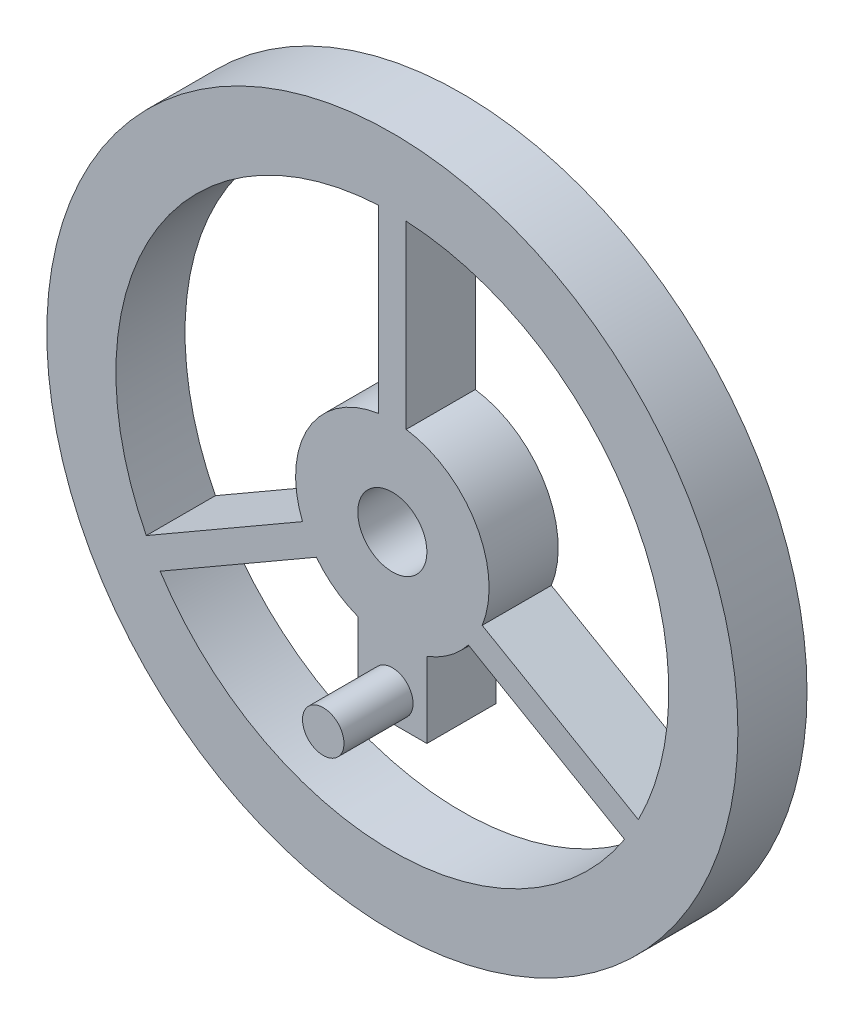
ISO-10303-21;
HEADER;
FILE_DESCRIPTION(('STEP AP214'),'2;1');
FILE_NAME('part.step','',(''),(''),'','','');
FILE_SCHEMA(('AUTOMOTIVE_DESIGN { 1 0 10303 214 1 1 1 1 }'));
ENDSEC;
DATA;
#1=APPLICATION_CONTEXT('core data for automotive mechanical design processes');
#2=APPLICATION_PROTOCOL_DEFINITION('international standard','automotive_design',2000,#1);
#3=PRODUCT_CONTEXT('',#1,'mechanical');
#4=PRODUCT('Part','Part','',(#3));
#5=PRODUCT_RELATED_PRODUCT_CATEGORY('part','',(#4));
#6=PRODUCT_DEFINITION_FORMATION('','',#4);
#7=PRODUCT_DEFINITION_CONTEXT('part definition',#1,'design');
#8=PRODUCT_DEFINITION('design','',#6,#7);
#9=PRODUCT_DEFINITION_SHAPE('','',#8);
#10=(LENGTH_UNIT() NAMED_UNIT(*) SI_UNIT(.MILLI.,.METRE.));
#11=(NAMED_UNIT(*) PLANE_ANGLE_UNIT() SI_UNIT($,.RADIAN.));
#12=(NAMED_UNIT(*) SI_UNIT($,.STERADIAN.) SOLID_ANGLE_UNIT());
#13=UNCERTAINTY_MEASURE_WITH_UNIT(LENGTH_MEASURE(1.E-05),#10,'distance_accuracy_value','');
#14=(GEOMETRIC_REPRESENTATION_CONTEXT(3) GLOBAL_UNCERTAINTY_ASSIGNED_CONTEXT((#13)) GLOBAL_UNIT_ASSIGNED_CONTEXT((#10,
#11,#12)) REPRESENTATION_CONTEXT('',''));
#15=CARTESIAN_POINT('',(0.,0.,0.));
#16=DIRECTION('',(0.,0.,1.));
#17=DIRECTION('',(1.,0.,0.));
#18=AXIS2_PLACEMENT_3D('',#15,#16,#17);
#19=CARTESIAN_POINT('',(0.49999999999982,0.866025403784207,-5.));
#20=DIRECTION('',(0.499999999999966,0.866025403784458,0.));
#21=DIRECTION('',(-0.866025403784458,0.499999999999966,0.));
#22=AXIS2_PLACEMENT_3D('',#19,#20,#21);
#23=PLANE('',#22);
#24=DIRECTION('',(-0.866025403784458,0.499999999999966,0.));
#25=VECTOR('',#24,1.);
#26=CARTESIAN_POINT('',(0.49999999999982,0.866025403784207,0.));
#27=LINE('',#26,#25);
#28=CARTESIAN_POINT('',(17.7988438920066,-9.12146677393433,0.));
#29=VERTEX_POINT('',#28);
#30=CARTESIAN_POINT('',(6.49999999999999,-2.59807621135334,0.));
#31=VERTEX_POINT('',#30);
#32=EDGE_CURVE('E224',#29,#31,#27,.T.);
#33=ORIENTED_EDGE('',*,*,#32,.F.);
#34=DIRECTION('',(0.,0.,1.));
#35=VECTOR('',#34,1.);
#36=CARTESIAN_POINT('',(17.7988438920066,-9.12146677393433,-5.));
#37=LINE('',#36,#35);
#38=CARTESIAN_POINT('',(17.7988438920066,-9.12146677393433,-5.));
#39=VERTEX_POINT('',#38);
#40=EDGE_CURVE('E11',#39,#29,#37,.T.);
#41=ORIENTED_EDGE('',*,*,#40,.F.);
#42=DIRECTION('',(-0.866025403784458,0.499999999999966,0.));
#43=VECTOR('',#42,1.);
#44=CARTESIAN_POINT('',(0.49999999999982,0.866025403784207,-5.));
#45=LINE('',#44,#43);
#46=CARTESIAN_POINT('',(6.49999999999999,-2.59807621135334,-5.));
#47=VERTEX_POINT('',#46);
#48=EDGE_CURVE('E171',#39,#47,#45,.T.);
#49=ORIENTED_EDGE('',*,*,#48,.T.);
#50=DIRECTION('',(0.,0.,1.));
#51=VECTOR('',#50,1.);
#52=CARTESIAN_POINT('',(6.49999999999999,-2.59807621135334,-5.));
#53=LINE('',#52,#51);
#54=EDGE_CURVE('E168',#47,#31,#53,.T.);
#55=ORIENTED_EDGE('',*,*,#54,.T.);
#56=EDGE_LOOP('',(#33,#41,#49,#55));
#57=FACE_BOUND('',#56,.T.);
#58=ADVANCED_FACE('F32',(#57),#23,.T.);
#59=CARTESIAN_POINT('',(0.,0.,-5.));
#60=DIRECTION('',(0.,0.,1.));
#61=DIRECTION('',(1.,0.,0.));
#62=AXIS2_PLACEMENT_3D('',#59,#60,#61);
#63=CYLINDRICAL_SURFACE('',#62,20.0000000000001);
#64=CARTESIAN_POINT('',(0.,0.,0.));
#65=DIRECTION('',(0.,0.,1.));
#66=DIRECTION('',(1.,0.,0.));
#67=AXIS2_PLACEMENT_3D('',#64,#65,#66);
#68=CIRCLE('',#67,20.0000000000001);
#69=CARTESIAN_POINT('',(1.,19.9749843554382,0.));
#70=VERTEX_POINT('',#69);
#71=EDGE_CURVE('E230',#29,#70,#68,.T.);
#72=ORIENTED_EDGE('',*,*,#71,.T.);
#73=DIRECTION('',(0.,0.,1.));
#74=VECTOR('',#73,1.);
#75=CARTESIAN_POINT('',(1.,19.9749843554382,-5.));
#76=LINE('',#75,#74);
#77=CARTESIAN_POINT('',(1.,19.9749843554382,-5.));
#78=VERTEX_POINT('',#77);
#79=EDGE_CURVE('E42',#78,#70,#76,.T.);
#80=ORIENTED_EDGE('',*,*,#79,.F.);
#81=CARTESIAN_POINT('',(0.,0.,-5.));
#82=DIRECTION('',(0.,0.,1.));
#83=DIRECTION('',(1.,0.,0.));
#84=AXIS2_PLACEMENT_3D('',#81,#82,#83);
#85=CIRCLE('',#84,20.0000000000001);
#86=EDGE_CURVE('E160',#39,#78,#85,.T.);
#87=ORIENTED_EDGE('',*,*,#86,.F.);
#88=ORIENTED_EDGE('',*,*,#40,.T.);
#89=EDGE_LOOP('',(#72,#80,#87,#88));
#90=FACE_BOUND('',#89,.T.);
#91=ADVANCED_FACE('F345',(#90),#63,.F.);
#92=CARTESIAN_POINT('',(1.,0.,-5.));
#93=DIRECTION('',(-1.,0.,0.));
#94=DIRECTION('',(0.,-1.,0.));
#95=AXIS2_PLACEMENT_3D('',#92,#93,#94);
#96=PLANE('',#95);
#97=DIRECTION('',(0.,-1.,0.));
#98=VECTOR('',#97,1.);
#99=CARTESIAN_POINT('',(1.,0.,0.));
#100=LINE('',#99,#98);
#101=CARTESIAN_POINT('',(1.,6.92820323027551,0.));
#102=VERTEX_POINT('',#101);
#103=EDGE_CURVE('E103',#70,#102,#100,.T.);
#104=ORIENTED_EDGE('',*,*,#103,.T.);
#105=DIRECTION('',(0.,0.,1.));
#106=VECTOR('',#105,1.);
#107=CARTESIAN_POINT('',(1.,6.92820323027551,-5.));
#108=LINE('',#107,#106);
#109=CARTESIAN_POINT('',(1.,6.92820323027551,-5.));
#110=VERTEX_POINT('',#109);
#111=EDGE_CURVE('E164',#110,#102,#108,.T.);
#112=ORIENTED_EDGE('',*,*,#111,.F.);
#113=DIRECTION('',(0.,-1.,0.));
#114=VECTOR('',#113,1.);
#115=CARTESIAN_POINT('',(1.,0.,-5.));
#116=LINE('',#115,#114);
#117=EDGE_CURVE('E154',#78,#110,#116,.T.);
#118=ORIENTED_EDGE('',*,*,#117,.F.);
#119=ORIENTED_EDGE('',*,*,#79,.T.);
#120=EDGE_LOOP('',(#104,#112,#118,#119));
#121=FACE_BOUND('',#120,.T.);
#122=ADVANCED_FACE('F165',(#121),#96,.F.);
#123=CARTESIAN_POINT('',(0.500000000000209,-0.866025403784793,-5.));
#124=DIRECTION('',(0.5,-0.866025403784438,0.));
#125=DIRECTION('',(0.866025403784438,0.5,0.));
#126=AXIS2_PLACEMENT_3D('',#123,#124,#125);
#127=PLANE('',#126);
#128=DIRECTION('',(0.866025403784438,0.5,0.));
#129=VECTOR('',#128,1.);
#130=CARTESIAN_POINT('',(0.500000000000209,-0.866025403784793,0.));
#131=LINE('',#130,#129);
#132=CARTESIAN_POINT('',(-16.7988438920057,-10.8535175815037,0.));
#133=VERTEX_POINT('',#132);
#134=CARTESIAN_POINT('',(-5.49999999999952,-4.33012701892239,0.));
#135=VERTEX_POINT('',#134);
#136=EDGE_CURVE('E200',#133,#135,#131,.T.);
#137=ORIENTED_EDGE('',*,*,#136,.F.);
#138=DIRECTION('',(0.,0.,1.));
#139=VECTOR('',#138,1.);
#140=CARTESIAN_POINT('',(-16.7988438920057,-10.8535175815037,-5.));
#141=LINE('',#140,#139);
#142=CARTESIAN_POINT('',(-16.7988438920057,-10.8535175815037,-5.));
#143=VERTEX_POINT('',#142);
#144=EDGE_CURVE('E235',#143,#133,#141,.T.);
#145=ORIENTED_EDGE('',*,*,#144,.F.);
#146=DIRECTION('',(0.866025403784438,0.5,0.));
#147=VECTOR('',#146,1.);
#148=CARTESIAN_POINT('',(0.500000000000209,-0.866025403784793,-5.));
#149=LINE('',#148,#147);
#150=CARTESIAN_POINT('',(-5.49999999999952,-4.33012701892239,-5.));
#151=VERTEX_POINT('',#150);
#152=EDGE_CURVE('E276',#143,#151,#149,.T.);
#153=ORIENTED_EDGE('',*,*,#152,.T.);
#154=DIRECTION('',(0.,0.,1.));
#155=VECTOR('',#154,1.);
#156=CARTESIAN_POINT('',(-5.49999999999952,-4.33012701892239,-5.));
#157=LINE('',#156,#155);
#158=EDGE_CURVE('E250',#151,#135,#157,.T.);
#159=ORIENTED_EDGE('',*,*,#158,.T.);
#160=EDGE_LOOP('',(#137,#145,#153,#159));
#161=FACE_BOUND('',#160,.T.);
#162=ADVANCED_FACE('F339',(#161),#127,.T.);
#163=CARTESIAN_POINT('',(0.,0.,-5.));
#164=DIRECTION('',(0.,0.,1.));
#165=DIRECTION('',(1.,0.,0.));
#166=AXIS2_PLACEMENT_3D('',#163,#164,#165);
#167=CYLINDRICAL_SURFACE('',#166,19.9999999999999);
#168=CARTESIAN_POINT('',(0.,0.,0.));
#169=DIRECTION('',(0.,0.,1.));
#170=DIRECTION('',(1.,0.,0.));
#171=AXIS2_PLACEMENT_3D('',#168,#169,#170);
#172=CIRCLE('',#171,19.9999999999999);
#173=CARTESIAN_POINT('',(16.7988438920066,-10.8535175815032,0.));
#174=VERTEX_POINT('',#173);
#175=EDGE_CURVE('E221',#133,#174,#172,.T.);
#176=ORIENTED_EDGE('',*,*,#175,.T.);
#177=DIRECTION('',(0.,0.,1.));
#178=VECTOR('',#177,1.);
#179=CARTESIAN_POINT('',(16.7988438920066,-10.8535175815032,-5.));
#180=LINE('',#179,#178);
#181=CARTESIAN_POINT('',(16.7988438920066,-10.8535175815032,-5.));
#182=VERTEX_POINT('',#181);
#183=EDGE_CURVE('E237',#182,#174,#180,.T.);
#184=ORIENTED_EDGE('',*,*,#183,.F.);
#185=CARTESIAN_POINT('',(0.,0.,-5.));
#186=DIRECTION('',(0.,0.,1.));
#187=DIRECTION('',(1.,0.,0.));
#188=AXIS2_PLACEMENT_3D('',#185,#186,#187);
#189=CIRCLE('',#188,19.9999999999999);
#190=EDGE_CURVE('E173',#143,#182,#189,.T.);
#191=ORIENTED_EDGE('',*,*,#190,.F.);
#192=ORIENTED_EDGE('',*,*,#144,.T.);
#193=EDGE_LOOP('',(#176,#184,#191,#192));
#194=FACE_BOUND('',#193,.T.);
#195=ADVANCED_FACE('F315',(#194),#167,.F.);
#196=CARTESIAN_POINT('',(-0.500000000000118,-0.866025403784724,-5.));
#197=DIRECTION('',(0.499999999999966,0.866025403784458,0.));
#198=DIRECTION('',(-0.866025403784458,0.499999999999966,0.));
#199=AXIS2_PLACEMENT_3D('',#196,#197,#198);
#200=PLANE('',#199);
#201=DIRECTION('',(-0.866025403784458,0.499999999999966,0.));
#202=VECTOR('',#201,1.);
#203=CARTESIAN_POINT('',(-0.500000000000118,-0.866025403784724,0.));
#204=LINE('',#203,#202);
#205=CARTESIAN_POINT('',(5.49999999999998,-4.33012701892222,0.));
#206=VERTEX_POINT('',#205);
#207=EDGE_CURVE('E218',#174,#206,#204,.T.);
#208=ORIENTED_EDGE('',*,*,#207,.T.);
#209=DIRECTION('',(0.,0.,1.));
#210=VECTOR('',#209,1.);
#211=CARTESIAN_POINT('',(5.49999999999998,-4.33012701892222,-5.));
#212=LINE('',#211,#210);
#213=CARTESIAN_POINT('',(5.49999999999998,-4.33012701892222,-5.));
#214=VERTEX_POINT('',#213);
#215=EDGE_CURVE('E240',#214,#206,#212,.T.);
#216=ORIENTED_EDGE('',*,*,#215,.F.);
#217=DIRECTION('',(-0.866025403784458,0.499999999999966,0.));
#218=VECTOR('',#217,1.);
#219=CARTESIAN_POINT('',(-0.500000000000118,-0.866025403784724,-5.));
#220=LINE('',#219,#218);
#221=EDGE_CURVE('E306',#182,#214,#220,.T.);
#222=ORIENTED_EDGE('',*,*,#221,.F.);
#223=ORIENTED_EDGE('',*,*,#183,.T.);
#224=EDGE_LOOP('',(#208,#216,#222,#223));
#225=FACE_BOUND('',#224,.T.);
#226=ADVANCED_FACE('F318',(#225),#200,.F.);
#227=CARTESIAN_POINT('',(0.,0.,-5.));
#228=DIRECTION('',(0.,0.,1.));
#229=DIRECTION('',(1.,0.,0.));
#230=AXIS2_PLACEMENT_3D('',#227,#228,#229);
#231=CYLINDRICAL_SURFACE('',#230,7.);
#232=CARTESIAN_POINT('',(0.,0.,0.));
#233=DIRECTION('',(0.,0.,1.));
#234=DIRECTION('',(1.,0.,0.));
#235=AXIS2_PLACEMENT_3D('',#232,#233,#234);
#236=CIRCLE('',#235,7.);
#237=CARTESIAN_POINT('',(2.5,-6.53834841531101,0.));
#238=VERTEX_POINT('',#237);
#239=EDGE_CURVE('E215',#238,#206,#236,.T.);
#240=ORIENTED_EDGE('',*,*,#239,.F.);
#241=DIRECTION('',(0.,0.,1.));
#242=VECTOR('',#241,1.);
#243=CARTESIAN_POINT('',(2.5,-6.53834841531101,-5.));
#244=LINE('',#243,#242);
#245=CARTESIAN_POINT('',(2.5,-6.53834841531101,-5.));
#246=VERTEX_POINT('',#245);
#247=EDGE_CURVE('E242',#246,#238,#244,.T.);
#248=ORIENTED_EDGE('',*,*,#247,.F.);
#249=CARTESIAN_POINT('',(0.,0.,-5.));
#250=DIRECTION('',(0.,0.,1.));
#251=DIRECTION('',(1.,0.,0.));
#252=AXIS2_PLACEMENT_3D('',#249,#250,#251);
#253=CIRCLE('',#252,7.);
#254=EDGE_CURVE('E303',#246,#214,#253,.T.);
#255=ORIENTED_EDGE('',*,*,#254,.T.);
#256=ORIENTED_EDGE('',*,*,#215,.T.);
#257=EDGE_LOOP('',(#240,#248,#255,#256));
#258=FACE_BOUND('',#257,.T.);
#259=ADVANCED_FACE('F321',(#258),#231,.T.);
#260=CARTESIAN_POINT('',(2.5,0.,-5.));
#261=DIRECTION('',(1.,0.,0.));
#262=DIRECTION('',(0.,0.,-1.));
#263=AXIS2_PLACEMENT_3D('',#260,#261,#262);
#264=PLANE('',#263);
#265=DIRECTION('',(0.,1.,0.));
#266=VECTOR('',#265,1.);
#267=CARTESIAN_POINT('',(2.5,0.,0.));
#268=LINE('',#267,#266);
#269=CARTESIAN_POINT('',(2.5,-12.,0.));
#270=VERTEX_POINT('',#269);
#271=EDGE_CURVE('E212',#270,#238,#268,.T.);
#272=ORIENTED_EDGE('',*,*,#271,.F.);
#273=DIRECTION('',(0.,0.,1.));
#274=VECTOR('',#273,1.);
#275=CARTESIAN_POINT('',(2.5,-12.,-5.));
#276=LINE('',#275,#274);
#277=CARTESIAN_POINT('',(2.5,-12.,-5.));
#278=VERTEX_POINT('',#277);
#279=EDGE_CURVE('E244',#278,#270,#276,.T.);
#280=ORIENTED_EDGE('',*,*,#279,.F.);
#281=DIRECTION('',(0.,1.,0.));
#282=VECTOR('',#281,1.);
#283=CARTESIAN_POINT('',(2.5,0.,-5.));
#284=LINE('',#283,#282);
#285=EDGE_CURVE('E300',#278,#246,#284,.T.);
#286=ORIENTED_EDGE('',*,*,#285,.T.);
#287=ORIENTED_EDGE('',*,*,#247,.T.);
#288=EDGE_LOOP('',(#272,#280,#286,#287));
#289=FACE_BOUND('',#288,.T.);
#290=ADVANCED_FACE('F326',(#289),#264,.T.);
#291=CARTESIAN_POINT('',(0.,-12.,-5.));
#292=DIRECTION('',(0.,-1.,0.));
#293=DIRECTION('',(0.,0.,-1.));
#294=AXIS2_PLACEMENT_3D('',#291,#292,#293);
#295=PLANE('',#294);
#296=DIRECTION('',(1.,0.,0.));
#297=VECTOR('',#296,1.);
#298=CARTESIAN_POINT('',(0.,-12.,0.));
#299=LINE('',#298,#297);
#300=CARTESIAN_POINT('',(-2.5,-12.,0.));
#301=VERTEX_POINT('',#300);
#302=EDGE_CURVE('E209',#301,#270,#299,.T.);
#303=ORIENTED_EDGE('',*,*,#302,.F.);
#304=DIRECTION('',(0.,0.,1.));
#305=VECTOR('',#304,1.);
#306=CARTESIAN_POINT('',(-2.5,-12.,-5.));
#307=LINE('',#306,#305);
#308=CARTESIAN_POINT('',(-2.5,-12.,-5.));
#309=VERTEX_POINT('',#308);
#310=EDGE_CURVE('E246',#309,#301,#307,.T.);
#311=ORIENTED_EDGE('',*,*,#310,.F.);
#312=DIRECTION('',(1.,0.,0.));
#313=VECTOR('',#312,1.);
#314=CARTESIAN_POINT('',(0.,-12.,-5.));
#315=LINE('',#314,#313);
#316=EDGE_CURVE('E297',#309,#278,#315,.T.);
#317=ORIENTED_EDGE('',*,*,#316,.T.);
#318=ORIENTED_EDGE('',*,*,#279,.T.);
#319=EDGE_LOOP('',(#303,#311,#317,#318));
#320=FACE_BOUND('',#319,.T.);
#321=ADVANCED_FACE('F329',(#320),#295,.T.);
#322=CARTESIAN_POINT('',(-2.5,0.,-5.));
#323=DIRECTION('',(-1.,0.,0.));
#324=DIRECTION('',(0.,0.,1.));
#325=AXIS2_PLACEMENT_3D('',#322,#323,#324);
#326=PLANE('',#325);
#327=DIRECTION('',(0.,-1.,0.));
#328=VECTOR('',#327,1.);
#329=CARTESIAN_POINT('',(-2.5,0.,0.));
#330=LINE('',#329,#328);
#331=CARTESIAN_POINT('',(-2.5,-6.53834841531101,0.));
#332=VERTEX_POINT('',#331);
#333=EDGE_CURVE('E206',#332,#301,#330,.T.);
#334=ORIENTED_EDGE('',*,*,#333,.F.);
#335=DIRECTION('',(0.,0.,1.));
#336=VECTOR('',#335,1.);
#337=CARTESIAN_POINT('',(-2.5,-6.53834841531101,-5.));
#338=LINE('',#337,#336);
#339=CARTESIAN_POINT('',(-2.5,-6.53834841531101,-5.));
#340=VERTEX_POINT('',#339);
#341=EDGE_CURVE('E248',#340,#332,#338,.T.);
#342=ORIENTED_EDGE('',*,*,#341,.F.);
#343=DIRECTION('',(0.,-1.,0.));
#344=VECTOR('',#343,1.);
#345=CARTESIAN_POINT('',(-2.5,0.,-5.));
#346=LINE('',#345,#344);
#347=EDGE_CURVE('E294',#340,#309,#346,.T.);
#348=ORIENTED_EDGE('',*,*,#347,.T.);
#349=ORIENTED_EDGE('',*,*,#310,.T.);
#350=EDGE_LOOP('',(#334,#342,#348,#349));
#351=FACE_BOUND('',#350,.T.);
#352=ADVANCED_FACE('F333',(#351),#326,.T.);
#353=CARTESIAN_POINT('',(-1.00000000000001,0.,-5.));
#354=DIRECTION('',(-1.,0.,0.));
#355=DIRECTION('',(0.,-1.,0.));
#356=AXIS2_PLACEMENT_3D('',#353,#354,#355);
#357=PLANE('',#356);
#358=DIRECTION('',(0.,-1.,0.));
#359=VECTOR('',#358,1.);
#360=CARTESIAN_POINT('',(-1.00000000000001,0.,0.));
#361=LINE('',#360,#359);
#362=CARTESIAN_POINT('',(-1.,19.9749843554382,0.));
#363=VERTEX_POINT('',#362);
#364=CARTESIAN_POINT('',(-1.00000000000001,6.9282032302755,0.));
#365=VERTEX_POINT('',#364);
#366=EDGE_CURVE('E188',#363,#365,#361,.T.);
#367=ORIENTED_EDGE('',*,*,#366,.F.);
#368=DIRECTION('',(0.,0.,1.));
#369=VECTOR('',#368,1.);
#370=CARTESIAN_POINT('',(-1.,19.9749843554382,-5.));
#371=LINE('',#370,#369);
#372=CARTESIAN_POINT('',(-1.,19.9749843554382,-5.));
#373=VERTEX_POINT('',#372);
#374=EDGE_CURVE('E252',#373,#363,#371,.T.);
#375=ORIENTED_EDGE('',*,*,#374,.F.);
#376=DIRECTION('',(0.,-1.,0.));
#377=VECTOR('',#376,1.);
#378=CARTESIAN_POINT('',(-1.00000000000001,0.,-5.));
#379=LINE('',#378,#377);
#380=CARTESIAN_POINT('',(-1.00000000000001,6.9282032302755,-5.));
#381=VERTEX_POINT('',#380);
#382=EDGE_CURVE('E263',#373,#381,#379,.T.);
#383=ORIENTED_EDGE('',*,*,#382,.T.);
#384=DIRECTION('',(0.,0.,1.));
#385=VECTOR('',#384,1.);
#386=CARTESIAN_POINT('',(-1.00000000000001,6.9282032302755,-5.));
#387=LINE('',#386,#385);
#388=EDGE_CURVE('E36',#381,#365,#387,.T.);
#389=ORIENTED_EDGE('',*,*,#388,.T.);
#390=EDGE_LOOP('',(#367,#375,#383,#389));
#391=FACE_BOUND('',#390,.T.);
#392=ADVANCED_FACE('F261',(#391),#357,.T.);
#393=CARTESIAN_POINT('',(0.,0.,-5.));
#394=DIRECTION('',(0.,0.,1.));
#395=DIRECTION('',(1.,0.,0.));
#396=AXIS2_PLACEMENT_3D('',#393,#394,#395);
#397=CYLINDRICAL_SURFACE('',#396,19.9999999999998);
#398=CARTESIAN_POINT('',(0.,0.,0.));
#399=DIRECTION('',(0.,0.,1.));
#400=DIRECTION('',(1.,0.,0.));
#401=AXIS2_PLACEMENT_3D('',#398,#399,#400);
#402=CIRCLE('',#401,19.9999999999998);
#403=CARTESIAN_POINT('',(-17.7988438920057,-9.12146677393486,0.));
#404=VERTEX_POINT('',#403);
#405=EDGE_CURVE('E197',#363,#404,#402,.T.);
#406=ORIENTED_EDGE('',*,*,#405,.T.);
#407=DIRECTION('',(0.,0.,1.));
#408=VECTOR('',#407,1.);
#409=CARTESIAN_POINT('',(-17.7988438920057,-9.12146677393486,-5.));
#410=LINE('',#409,#408);
#411=CARTESIAN_POINT('',(-17.7988438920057,-9.12146677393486,-5.));
#412=VERTEX_POINT('',#411);
#413=EDGE_CURVE('E254',#412,#404,#410,.T.);
#414=ORIENTED_EDGE('',*,*,#413,.F.);
#415=CARTESIAN_POINT('',(0.,0.,-5.));
#416=DIRECTION('',(0.,0.,1.));
#417=DIRECTION('',(1.,0.,0.));
#418=AXIS2_PLACEMENT_3D('',#415,#416,#417);
#419=CIRCLE('',#418,19.9999999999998);
#420=EDGE_CURVE('E274',#373,#412,#419,.T.);
#421=ORIENTED_EDGE('',*,*,#420,.F.);
#422=ORIENTED_EDGE('',*,*,#374,.T.);
#423=EDGE_LOOP('',(#406,#414,#421,#422));
#424=FACE_BOUND('',#423,.T.);
#425=ADVANCED_FACE('F271',(#424),#397,.F.);
#426=CARTESIAN_POINT('',(-0.499999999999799,0.866025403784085,-5.));
#427=DIRECTION('',(0.5,-0.866025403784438,0.));
#428=DIRECTION('',(0.866025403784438,0.5,0.));
#429=AXIS2_PLACEMENT_3D('',#426,#427,#428);
#430=PLANE('',#429);
#431=DIRECTION('',(0.866025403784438,0.5,0.));
#432=VECTOR('',#431,1.);
#433=CARTESIAN_POINT('',(-0.499999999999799,0.866025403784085,0.));
#434=LINE('',#433,#432);
#435=CARTESIAN_POINT('',(-6.49999999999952,-2.59807621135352,0.));
#436=VERTEX_POINT('',#435);
#437=EDGE_CURVE('E194',#404,#436,#434,.T.);
#438=ORIENTED_EDGE('',*,*,#437,.T.);
#439=DIRECTION('',(0.,0.,1.));
#440=VECTOR('',#439,1.);
#441=CARTESIAN_POINT('',(-6.49999999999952,-2.59807621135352,-5.));
#442=LINE('',#441,#440);
#443=CARTESIAN_POINT('',(-6.49999999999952,-2.59807621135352,-5.));
#444=VERTEX_POINT('',#443);
#445=EDGE_CURVE('E256',#444,#436,#442,.T.);
#446=ORIENTED_EDGE('',*,*,#445,.F.);
#447=DIRECTION('',(0.866025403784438,0.5,0.));
#448=VECTOR('',#447,1.);
#449=CARTESIAN_POINT('',(-0.499999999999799,0.866025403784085,-5.));
#450=LINE('',#449,#448);
#451=EDGE_CURVE('E277',#412,#444,#450,.T.);
#452=ORIENTED_EDGE('',*,*,#451,.F.);
#453=ORIENTED_EDGE('',*,*,#413,.T.);
#454=EDGE_LOOP('',(#438,#446,#452,#453));
#455=FACE_BOUND('',#454,.T.);
#456=ADVANCED_FACE('F368',(#455),#430,.F.);
#457=CARTESIAN_POINT('',(0.,0.,-5.));
#458=DIRECTION('',(0.,0.,1.));
#459=DIRECTION('',(1.,0.,0.));
#460=AXIS2_PLACEMENT_3D('',#457,#458,#459);
#461=CYLINDRICAL_SURFACE('',#460,6.99999999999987);
#462=CARTESIAN_POINT('',(0.,0.,0.));
#463=DIRECTION('',(0.,0.,1.));
#464=DIRECTION('',(1.,0.,0.));
#465=AXIS2_PLACEMENT_3D('',#462,#463,#464);
#466=CIRCLE('',#465,6.99999999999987);
#467=EDGE_CURVE('E203',#135,#332,#466,.T.);
#468=ORIENTED_EDGE('',*,*,#467,.F.);
#469=ORIENTED_EDGE('',*,*,#158,.F.);
#470=CARTESIAN_POINT('',(0.,0.,-5.));
#471=DIRECTION('',(0.,0.,1.));
#472=DIRECTION('',(1.,0.,0.));
#473=AXIS2_PLACEMENT_3D('',#470,#471,#472);
#474=CIRCLE('',#473,6.99999999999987);
#475=EDGE_CURVE('E291',#151,#340,#474,.T.);
#476=ORIENTED_EDGE('',*,*,#475,.T.);
#477=ORIENTED_EDGE('',*,*,#341,.T.);
#478=EDGE_LOOP('',(#468,#469,#476,#477));
#479=FACE_BOUND('',#478,.T.);
#480=ADVANCED_FACE('F336',(#479),#461,.T.);
#481=CARTESIAN_POINT('',(0.,0.,-5.));
#482=DIRECTION('',(0.,0.,1.));
#483=DIRECTION('',(1.,0.,0.));
#484=AXIS2_PLACEMENT_3D('',#481,#482,#483);
#485=CYLINDRICAL_SURFACE('',#484,6.99999999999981);
#486=CARTESIAN_POINT('',(0.,0.,0.));
#487=DIRECTION('',(0.,0.,1.));
#488=DIRECTION('',(1.,0.,0.));
#489=AXIS2_PLACEMENT_3D('',#486,#487,#488);
#490=CIRCLE('',#489,6.99999999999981);
#491=EDGE_CURVE('E191',#365,#436,#490,.T.);
#492=ORIENTED_EDGE('',*,*,#491,.F.);
#493=ORIENTED_EDGE('',*,*,#388,.F.);
#494=CARTESIAN_POINT('',(0.,0.,-5.));
#495=DIRECTION('',(0.,0.,1.));
#496=DIRECTION('',(1.,0.,0.));
#497=AXIS2_PLACEMENT_3D('',#494,#495,#496);
#498=CIRCLE('',#497,6.99999999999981);
#499=EDGE_CURVE('E280',#381,#444,#498,.T.);
#500=ORIENTED_EDGE('',*,*,#499,.T.);
#501=ORIENTED_EDGE('',*,*,#445,.T.);
#502=EDGE_LOOP('',(#492,#493,#500,#501));
#503=FACE_BOUND('',#502,.T.);
#504=ADVANCED_FACE('F264',(#503),#485,.T.);
#505=CARTESIAN_POINT('',(0.,0.,-5.));
#506=DIRECTION('',(0.,0.,1.));
#507=DIRECTION('',(1.,0.,0.));
#508=AXIS2_PLACEMENT_3D('',#505,#506,#507);
#509=CYLINDRICAL_SURFACE('',#508,25.);
#510=CARTESIAN_POINT('',(0.,0.,-5.));
#511=DIRECTION('',(0.,0.,1.));
#512=DIRECTION('',(1.,0.,0.));
#513=AXIS2_PLACEMENT_3D('',#510,#511,#512);
#514=CIRCLE('',#513,25.);
#515=CARTESIAN_POINT('',(25.,0.,-5.));
#516=VERTEX_POINT('',#515);
#517=EDGE_CURVE('E281',#516,#516,#514,.T.);
#518=ORIENTED_EDGE('',*,*,#517,.T.);
#519=EDGE_LOOP('',(#518));
#520=FACE_BOUND('',#519,.T.);
#521=CARTESIAN_POINT('',(0.,0.,0.));
#522=DIRECTION('',(0.,0.,1.));
#523=DIRECTION('',(1.,0.,0.));
#524=AXIS2_PLACEMENT_3D('',#521,#522,#523);
#525=CIRCLE('',#524,25.);
#526=CARTESIAN_POINT('',(25.,0.,0.));
#527=VERTEX_POINT('',#526);
#528=EDGE_CURVE('E185',#527,#527,#525,.T.);
#529=ORIENTED_EDGE('',*,*,#528,.F.);
#530=EDGE_LOOP('',(#529));
#531=FACE_BOUND('',#530,.T.);
#532=ADVANCED_FACE('F378',(#520,#531),#509,.T.);
#533=CARTESIAN_POINT('',(0.,0.,-5.));
#534=DIRECTION('',(0.,0.,1.));
#535=DIRECTION('',(1.,0.,0.));
#536=AXIS2_PLACEMENT_3D('',#533,#534,#535);
#537=CYLINDRICAL_SURFACE('',#536,2.5);
#538=CARTESIAN_POINT('',(0.,0.,-5.));
#539=DIRECTION('',(0.,0.,1.));
#540=DIRECTION('',(1.,0.,0.));
#541=AXIS2_PLACEMENT_3D('',#538,#539,#540);
#542=CIRCLE('',#541,2.5);
#543=CARTESIAN_POINT('',(2.5,0.,-5.));
#544=VERTEX_POINT('',#543);
#545=EDGE_CURVE('E231',#544,#544,#542,.T.);
#546=ORIENTED_EDGE('',*,*,#545,.F.);
#547=EDGE_LOOP('',(#546));
#548=FACE_BOUND('',#547,.T.);
#549=CARTESIAN_POINT('',(0.,0.,0.));
#550=DIRECTION('',(0.,0.,1.));
#551=DIRECTION('',(1.,0.,0.));
#552=AXIS2_PLACEMENT_3D('',#549,#550,#551);
#553=CIRCLE('',#552,2.5);
#554=CARTESIAN_POINT('',(2.5,0.,0.));
#555=VERTEX_POINT('',#554);
#556=EDGE_CURVE('E181',#555,#555,#553,.T.);
#557=ORIENTED_EDGE('',*,*,#556,.T.);
#558=EDGE_LOOP('',(#557));
#559=FACE_BOUND('',#558,.T.);
#560=ADVANCED_FACE('F34',(#548,#559),#537,.F.);
#561=CARTESIAN_POINT('',(0.,0.,-5.));
#562=DIRECTION('',(0.,0.,1.));
#563=DIRECTION('',(1.,0.,0.));
#564=AXIS2_PLACEMENT_3D('',#561,#562,#563);
#565=CYLINDRICAL_SURFACE('',#564,7.);
#566=CARTESIAN_POINT('',(0.,0.,0.));
#567=DIRECTION('',(0.,0.,1.));
#568=DIRECTION('',(1.,0.,0.));
#569=AXIS2_PLACEMENT_3D('',#566,#567,#568);
#570=CIRCLE('',#569,7.);
#571=EDGE_CURVE('E227',#31,#102,#570,.T.);
#572=ORIENTED_EDGE('',*,*,#571,.F.);
#573=ORIENTED_EDGE('',*,*,#54,.F.);
#574=CARTESIAN_POINT('',(0.,0.,-5.));
#575=DIRECTION('',(0.,0.,1.));
#576=DIRECTION('',(1.,0.,0.));
#577=AXIS2_PLACEMENT_3D('',#574,#575,#576);
#578=CIRCLE('',#577,7.);
#579=EDGE_CURVE('E159',#47,#110,#578,.T.);
#580=ORIENTED_EDGE('',*,*,#579,.T.);
#581=ORIENTED_EDGE('',*,*,#111,.T.);
#582=EDGE_LOOP('',(#572,#573,#580,#581));
#583=FACE_BOUND('',#582,.T.);
#584=ADVANCED_FACE('F170',(#583),#565,.T.);
#585=CARTESIAN_POINT('',(0.,0.,-5.));
#586=DIRECTION('',(0.,0.,1.));
#587=DIRECTION('',(1.,0.,0.));
#588=AXIS2_PLACEMENT_3D('',#585,#586,#587);
#589=PLANE('',#588);
#590=ORIENTED_EDGE('',*,*,#545,.T.);
#591=EDGE_LOOP('',(#590));
#592=FACE_BOUND('',#591,.T.);
#593=ORIENTED_EDGE('',*,*,#517,.F.);
#594=EDGE_LOOP('',(#593));
#595=FACE_BOUND('',#594,.T.);
#596=ORIENTED_EDGE('',*,*,#382,.F.);
#597=ORIENTED_EDGE('',*,*,#420,.T.);
#598=ORIENTED_EDGE('',*,*,#451,.T.);
#599=ORIENTED_EDGE('',*,*,#499,.F.);
#600=EDGE_LOOP('',(#596,#597,#598,#599));
#601=FACE_BOUND('',#600,.T.);
#602=ORIENTED_EDGE('',*,*,#152,.F.);
#603=ORIENTED_EDGE('',*,*,#190,.T.);
#604=ORIENTED_EDGE('',*,*,#221,.T.);
#605=ORIENTED_EDGE('',*,*,#254,.F.);
#606=ORIENTED_EDGE('',*,*,#285,.F.);
#607=ORIENTED_EDGE('',*,*,#316,.F.);
#608=ORIENTED_EDGE('',*,*,#347,.F.);
#609=ORIENTED_EDGE('',*,*,#475,.F.);
#610=EDGE_LOOP('',(#602,#603,#604,#605,#606,#607,#608,#609));
#611=FACE_BOUND('',#610,.T.);
#612=ORIENTED_EDGE('',*,*,#48,.F.);
#613=ORIENTED_EDGE('',*,*,#86,.T.);
#614=ORIENTED_EDGE('',*,*,#117,.T.);
#615=ORIENTED_EDGE('',*,*,#579,.F.);
#616=EDGE_LOOP('',(#612,#613,#614,#615));
#617=FACE_BOUND('',#616,.T.);
#618=ADVANCED_FACE('F157',(#592,#595,#601,#611,#617),#589,.F.);
#619=CARTESIAN_POINT('',(0.,0.,0.));
#620=DIRECTION('',(0.,0.,1.));
#621=DIRECTION('',(1.,0.,0.));
#622=AXIS2_PLACEMENT_3D('',#619,#620,#621);
#623=PLANE('',#622);
#624=CARTESIAN_POINT('',(0.,-10.,0.));
#625=DIRECTION('',(0.,0.,1.));
#626=DIRECTION('',(1.,0.,0.));
#627=AXIS2_PLACEMENT_3D('',#624,#625,#626);
#628=CIRCLE('',#627,1.5);
#629=CARTESIAN_POINT('',(1.5,-10.,0.));
#630=VERTEX_POINT('',#629);
#631=EDGE_CURVE('E178',#630,#630,#628,.T.);
#632=ORIENTED_EDGE('',*,*,#631,.F.);
#633=EDGE_LOOP('',(#632));
#634=FACE_BOUND('',#633,.T.);
#635=ORIENTED_EDGE('',*,*,#556,.F.);
#636=EDGE_LOOP('',(#635));
#637=FACE_BOUND('',#636,.T.);
#638=ORIENTED_EDGE('',*,*,#528,.T.);
#639=EDGE_LOOP('',(#638));
#640=FACE_BOUND('',#639,.T.);
#641=ORIENTED_EDGE('',*,*,#366,.T.);
#642=ORIENTED_EDGE('',*,*,#491,.T.);
#643=ORIENTED_EDGE('',*,*,#437,.F.);
#644=ORIENTED_EDGE('',*,*,#405,.F.);
#645=EDGE_LOOP('',(#641,#642,#643,#644));
#646=FACE_BOUND('',#645,.T.);
#647=ORIENTED_EDGE('',*,*,#136,.T.);
#648=ORIENTED_EDGE('',*,*,#467,.T.);
#649=ORIENTED_EDGE('',*,*,#333,.T.);
#650=ORIENTED_EDGE('',*,*,#302,.T.);
#651=ORIENTED_EDGE('',*,*,#271,.T.);
#652=ORIENTED_EDGE('',*,*,#239,.T.);
#653=ORIENTED_EDGE('',*,*,#207,.F.);
#654=ORIENTED_EDGE('',*,*,#175,.F.);
#655=EDGE_LOOP('',(#647,#648,#649,#650,#651,#652,#653,#654));
#656=FACE_BOUND('',#655,.T.);
#657=ORIENTED_EDGE('',*,*,#32,.T.);
#658=ORIENTED_EDGE('',*,*,#571,.T.);
#659=ORIENTED_EDGE('',*,*,#103,.F.);
#660=ORIENTED_EDGE('',*,*,#71,.F.);
#661=EDGE_LOOP('',(#657,#658,#659,#660));
#662=FACE_BOUND('',#661,.T.);
#663=ADVANCED_FACE('F267',(#634,#637,#640,#646,#656,#662),#623,.T.);
#664=CARTESIAN_POINT('',(0.,0.,5.));
#665=DIRECTION('',(0.,0.,1.));
#666=DIRECTION('',(1.,0.,0.));
#667=AXIS2_PLACEMENT_3D('',#664,#665,#666);
#668=PLANE('',#667);
#669=CARTESIAN_POINT('',(0.,-10.,5.));
#670=DIRECTION('',(0.,0.,1.));
#671=DIRECTION('',(1.,0.,0.));
#672=AXIS2_PLACEMENT_3D('',#669,#670,#671);
#673=CIRCLE('',#672,1.5);
#674=CARTESIAN_POINT('',(1.5,-10.,5.));
#675=VERTEX_POINT('',#674);
#676=EDGE_CURVE('E182',#675,#675,#673,.T.);
#677=ORIENTED_EDGE('',*,*,#676,.T.);
#678=EDGE_LOOP('',(#677));
#679=FACE_BOUND('',#678,.T.);
#680=ADVANCED_FACE('F341',(#679),#668,.T.);
#681=CARTESIAN_POINT('',(0.,-10.,5.));
#682=DIRECTION('',(0.,0.,-1.));
#683=DIRECTION('',(-1.,0.,0.));
#684=AXIS2_PLACEMENT_3D('',#681,#682,#683);
#685=CYLINDRICAL_SURFACE('',#684,1.5);
#686=ORIENTED_EDGE('',*,*,#631,.T.);
#687=EDGE_LOOP('',(#686));
#688=FACE_BOUND('',#687,.T.);
#689=ORIENTED_EDGE('',*,*,#676,.F.);
#690=EDGE_LOOP('',(#689));
#691=FACE_BOUND('',#690,.T.);
#692=ADVANCED_FACE('F399',(#688,#691),#685,.T.);
#693=CLOSED_SHELL('',(#58,#91,#122,#162,#195,#226,#259,#290,#321,#352,#392,#425,#456,#480,#504,
#532,#560,#584,#618,#663,#680,#692));
#694=MANIFOLD_SOLID_BREP('B2',#693);
#695=ADVANCED_BREP_SHAPE_REPRESENTATION('',(#18,#694),#14);
#696=SHAPE_DEFINITION_REPRESENTATION(#9,#695);
ENDSEC;
END-ISO-10303-21;
